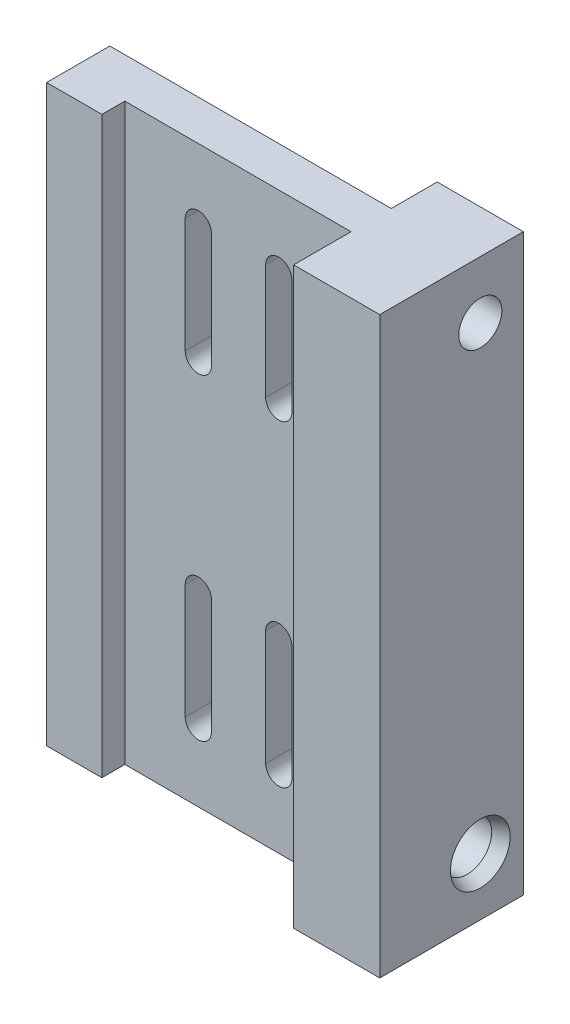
from build123d import *

# Parameters (mm, degrees)
SKETCH1_W                         = 40.63238
SKETCH1_H                         = 63.5
EXTRUDE1_DEPTH                    = 15.875
SKETCH3_W                         = 25
SKETCH3_H                         = 6.35
SKETCH3_W_2                       = 31.10738
SKETCH3_H_2                       = 5.08
CUT_EXTRUDE1_DEPTH                = 71.579178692
SKETCH4_R                         = 2.38125
CUT_EXTRUDE2_DEPTH                = 9.525
F_1_4_28_TAPPED_HOLE1_D           = 5.4102
F_1_4_28_TAPPED_HOLE1_DEPTH       = 12.192
F_1_4_28_TAPPED_HOLE1_CSINK_D     = 6.604
F_1_4_28_TAPPED_HOLE1_CSINK_ANGLE = 45
F_1_4_28_TAPPED_HOLE1_TIP         = 1.625388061
SKETCH7_W                         = 6.10738
SKETCH7_H                         = 63.5
CUT_EXTRUDE3_DEPTH                = 3.81


with BuildPart() as part:
    # Sketch1 → Extrude1 (new body)
    with BuildSketch(Plane.XY):
        with Locations((6.08749989, -17.526)):
            Rectangle(SKETCH1_W, SKETCH1_H)
        with BuildLine():
            Line((-1.449999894, 6.35), (-1.449999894, -6.35))
            ThreePointArc((-1.449999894, -6.35), (1.27e-07, -7.800000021), (1.450000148, -6.35))
            Line((1.450000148, -6.35), (1.450000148, 6.35))
            ThreePointArc((1.450000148, 6.35), (1.27e-07, 7.800000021), (-1.449999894, 6.35))
        make_face(mode=Mode.SUBTRACT)
        with BuildLine():
            Line((10.340000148, 6.35), (10.340000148, -6.35))
            ThreePointArc((10.340000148, -6.35), (8.890000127, -7.800000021), (7.440000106, -6.35))
            Line((7.440000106, -6.35), (7.440000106, 6.35))
            ThreePointArc((7.440000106, 6.35), (8.890000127, 7.800000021), (10.340000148, 6.35))
        make_face(mode=Mode.SUBTRACT)
        with BuildLine():
            Line((1.450000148, -28.702), (1.450000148, -41.402))
            ThreePointArc((1.450000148, -41.402), (1.27e-07, -42.852000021), (-1.449999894, -41.402))
            Line((-1.449999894, -41.402), (-1.449999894, -28.702))
            ThreePointArc((-1.449999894, -28.702), (1.27e-07, -27.251999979), (1.450000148, -28.702))
        make_face(mode=Mode.SUBTRACT)
        with BuildLine():
            Line((10.340000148, -28.702), (10.340000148, -41.402))
            ThreePointArc((10.340000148, -41.402), (8.890000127, -42.852000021), (7.440000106, -41.402))
            Line((7.440000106, -41.402), (7.440000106, -28.702))
            ThreePointArc((7.440000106, -28.702), (8.890000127, -27.251999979), (10.340000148, -28.702))
        make_face(mode=Mode.SUBTRACT)
    extrude(amount=EXTRUDE1_DEPTH)

    # Sketch3 → Cut-Extrude1 (cut, through all)
    with BuildSketch(Plane(origin=(0, 14.224, 0), x_dir=(-1, 0, 0), z_dir=(0, 1, 0))):
        with Locations((-4.37868989, 12.7)):
            Rectangle(SKETCH3_W, SKETCH3_H)
        with Locations((-1.32499989, 2.54)):
            Rectangle(SKETCH3_W_2, SKETCH3_H_2)
    extrude(amount=-CUT_EXTRUDE1_DEPTH, mode=Mode.SUBTRACT)

    # Sketch4 → Cut-Extrude2 (cut)
    with BuildSketch(Plane(origin=(26.40368989, 0, 0), x_dir=(0, 0, -1), z_dir=(1, 0, 0))):
        with Locations(Location((-4.7625, 7.874, 0), (0, 0, 90))):
            Circle(SKETCH4_R)
    extrude(amount=-CUT_EXTRUDE2_DEPTH, mode=Mode.SUBTRACT)

    # 1_4-28 Tapped Hole1
    with Locations(Plane(origin=(26.40368989, -42.926, 4.7625), x_dir=(0, 1, 0), z_dir=(1, 0, 0))):
        with Locations((0, 0)):
            CounterSinkHole(F_1_4_28_TAPPED_HOLE1_D / 2, F_1_4_28_TAPPED_HOLE1_CSINK_D / 2, depth=F_1_4_28_TAPPED_HOLE1_DEPTH, counter_sink_angle=F_1_4_28_TAPPED_HOLE1_CSINK_ANGLE)
            with Locations((0, 0, -(F_1_4_28_TAPPED_HOLE1_DEPTH + F_1_4_28_TAPPED_HOLE1_TIP / 2))):  # 118° drill point
                Cone(0, F_1_4_28_TAPPED_HOLE1_D / 2, F_1_4_28_TAPPED_HOLE1_TIP, mode=Mode.SUBTRACT)

    # Sketch7 → Cut-Extrude3 (cut)
    with BuildSketch(Plane.XY.offset(15.875)):
        with Locations((-11.17500011, -17.526)):
            Rectangle(SKETCH7_W, SKETCH7_H)
    extrude(amount=-CUT_EXTRUDE3_DEPTH, mode=Mode.SUBTRACT)


solid = part.part
